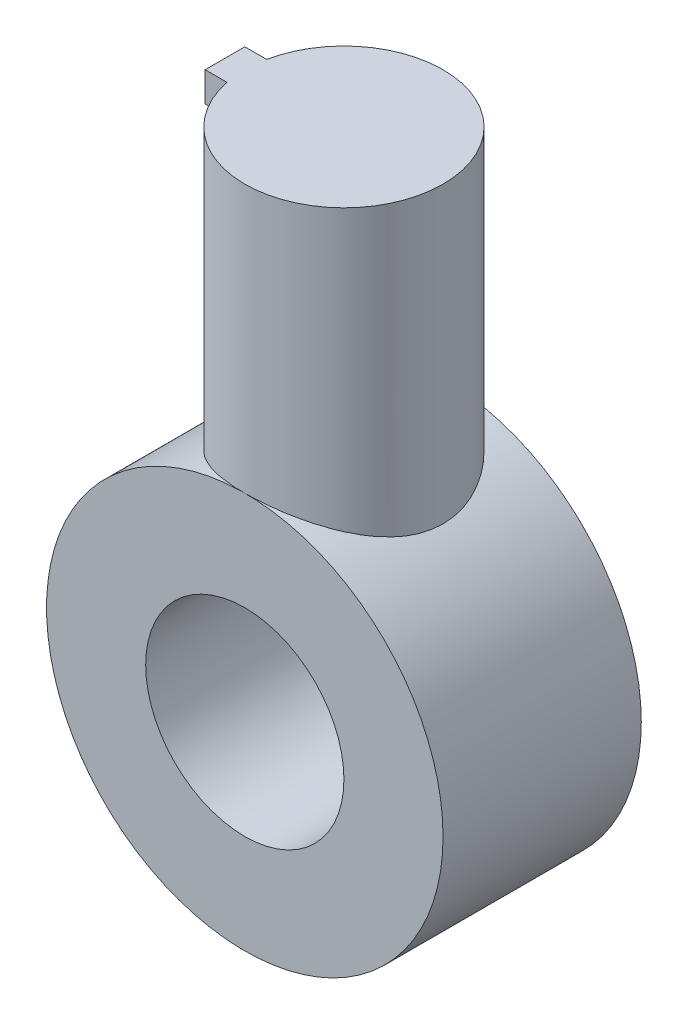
from build123d import *

# Parameters (mm, degrees)
SKETCH1_R           = 20
SKETCH1_R_2         = 10
BOSS_EXTRUDE1_DEPTH = 20
SKETCH2_R           = 10
BOSS_EXTRUDE2_DEPTH = 30
BOSS_EXTRUDE3_DEPTH = 3


with BuildPart() as part:
    # Sketch1 → Boss-Extrude1 (new body)
    with BuildSketch(Plane.XY):
        Circle(SKETCH1_R)
        Circle(SKETCH1_R_2, mode=Mode.SUBTRACT)
    extrude(amount=BOSS_EXTRUDE1_DEPTH)


with BuildPart() as body_2:
    # Sketch2 → Boss-Extrude2 (new body)
    with BuildSketch(Plane(origin=(0, 17, 0), x_dir=(1, 0, 0), z_dir=(0, 1, 0))):
        with Locations(Location((0, -10, 0), (0, 0, 270))):
            Circle(SKETCH2_R)
    extrude(amount=BOSS_EXTRUDE2_DEPTH)

    # Sketch3 → Boss-Extrude3 (add)
    with BuildSketch(Plane(origin=(0, 47, 0), x_dir=(1, 0, 0), z_dir=(0, 1, 0))):
        with BuildLine():
            Line((-9.797958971, -8), (-12, -8))
            Line((-12, -8), (-12, -12))
            Line((-12, -12), (-9.797958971, -12))
            ThreePointArc((-9.797958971, -12), (-10, -10), (-9.797958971, -8))
        make_face()
    extrude(amount=-BOSS_EXTRUDE3_DEPTH)


solid = Compound([part.part, body_2.part])
